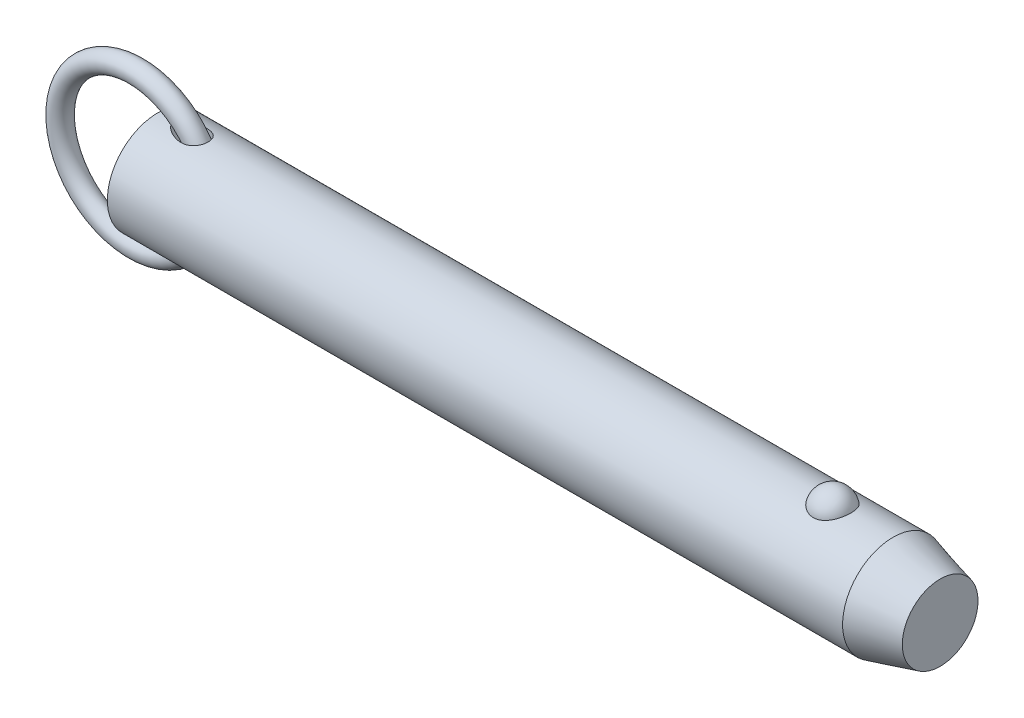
ISO-10303-21;
HEADER;
FILE_DESCRIPTION(('STEP AP214'),'2;1');
FILE_NAME('part.step','',(''),(''),'','','');
FILE_SCHEMA(('AUTOMOTIVE_DESIGN { 1 0 10303 214 1 1 1 1 }'));
ENDSEC;
DATA;
#1=APPLICATION_CONTEXT('core data for automotive mechanical design processes');
#2=APPLICATION_PROTOCOL_DEFINITION('international standard','automotive_design',2000,#1);
#3=PRODUCT_CONTEXT('',#1,'mechanical');
#4=PRODUCT('Part','Part','',(#3));
#5=PRODUCT_RELATED_PRODUCT_CATEGORY('part','',(#4));
#6=PRODUCT_DEFINITION_FORMATION('','',#4);
#7=PRODUCT_DEFINITION_CONTEXT('part definition',#1,'design');
#8=PRODUCT_DEFINITION('design','',#6,#7);
#9=PRODUCT_DEFINITION_SHAPE('','',#8);
#10=(LENGTH_UNIT() NAMED_UNIT(*) SI_UNIT(.MILLI.,.METRE.));
#11=(NAMED_UNIT(*) PLANE_ANGLE_UNIT() SI_UNIT($,.RADIAN.));
#12=(NAMED_UNIT(*) SI_UNIT($,.STERADIAN.) SOLID_ANGLE_UNIT());
#13=UNCERTAINTY_MEASURE_WITH_UNIT(LENGTH_MEASURE(1.E-05),#10,'distance_accuracy_value','');
#14=(GEOMETRIC_REPRESENTATION_CONTEXT(3) GLOBAL_UNCERTAINTY_ASSIGNED_CONTEXT((#13)) GLOBAL_UNIT_ASSIGNED_CONTEXT((#10,
#11,#12)) REPRESENTATION_CONTEXT('',''));
#15=CARTESIAN_POINT('',(0.,0.,0.));
#16=DIRECTION('',(0.,0.,1.));
#17=DIRECTION('',(1.,0.,0.));
#18=AXIS2_PLACEMENT_3D('',#15,#16,#17);
#19=CARTESIAN_POINT('',(-5.53898640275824,0.,0.));
#20=DIRECTION('',(0.,0.,1.));
#21=DIRECTION('',(1.,0.,0.));
#22=AXIS2_PLACEMENT_3D('',#19,#20,#21);
#23=TOROIDAL_SURFACE('',#22,19.05,2.54);
#24=CARTESIAN_POINT('',(16.0510135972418,0.,0.));
#25=VERTEX_POINT('',#24);
#26=VERTEX_LOOP('',#25);
#27=FACE_BOUND('',#26,.T.);
#28=ADVANCED_FACE('P0_F12',(#27),#23,.T.);
#29=CLOSED_SHELL('',(#28));
#30=MANIFOLD_SOLID_BREP('P0_B1',#29);
#31=CARTESIAN_POINT('',(0.,0.,0.));
#32=DIRECTION('',(1.,0.,0.));
#33=DIRECTION('',(0.,0.,-1.));
#34=AXIS2_PLACEMENT_3D('',#31,#32,#33);
#35=CYLINDRICAL_SURFACE('',#34,12.7);
#36=CARTESIAN_POINT('',(185.000738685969,0.,0.));
#37=DIRECTION('',(1.,0.,0.));
#38=DIRECTION('',(0.,0.,-1.));
#39=AXIS2_PLACEMENT_3D('',#36,#37,#38);
#40=CIRCLE('',#39,12.7);
#41=CARTESIAN_POINT('',(185.000738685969,0.,-12.7));
#42=VERTEX_POINT('',#41);
#43=EDGE_CURVE('P1_E89',#42,#42,#40,.T.);
#44=ORIENTED_EDGE('',*,*,#43,.F.);
#45=EDGE_LOOP('',(#44));
#46=FACE_BOUND('',#45,.T.);
#47=CARTESIAN_POINT('',(0.,0.,0.));
#48=DIRECTION('',(1.,0.,0.));
#49=DIRECTION('',(0.,0.,-1.));
#50=AXIS2_PLACEMENT_3D('',#47,#48,#49);
#51=CIRCLE('',#50,12.7);
#52=CARTESIAN_POINT('',(0.,0.,-12.7));
#53=VERTEX_POINT('',#52);
#54=EDGE_CURVE('P1_E52',#53,#53,#51,.T.);
#55=ORIENTED_EDGE('',*,*,#54,.T.);
#56=EDGE_LOOP('',(#55));
#57=FACE_BOUND('',#56,.T.);
#58=CARTESIAN_POINT('',(169.760042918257,11.7500437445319,4.81938502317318));
#59=CARTESIAN_POINT('',(169.635088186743,11.7500430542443,4.81938571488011));
#60=CARTESIAN_POINT('',(169.510144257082,11.7520975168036,4.81438658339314));
#61=CARTESIAN_POINT('',(169.261142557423,11.760253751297,4.79442904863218));
#62=CARTESIAN_POINT('',(169.137085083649,11.7663568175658,4.77946746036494));
#63=CARTESIAN_POINT('',(168.890901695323,11.7824262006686,4.7397141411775));
#64=CARTESIAN_POINT('',(168.768774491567,11.7923898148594,4.71492928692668));
#65=CARTESIAN_POINT('',(168.527187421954,11.8158938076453,4.65571340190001));
#66=CARTESIAN_POINT('',(168.40772859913,11.8294355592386,4.6212786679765));
#67=CARTESIAN_POINT('',(168.172557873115,11.8596812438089,4.54309502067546));
#68=CARTESIAN_POINT('',(168.056839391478,11.8763792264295,4.49936361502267));
#69=CARTESIAN_POINT('',(167.829653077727,11.9124878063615,4.40287235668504));
#70=CARTESIAN_POINT('',(167.718186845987,11.9318994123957,4.35010914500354));
#71=CARTESIAN_POINT('',(167.391278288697,11.9934256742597,4.17881316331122));
#72=CARTESIAN_POINT('',(167.183127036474,12.038858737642,4.04720756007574));
#73=CARTESIAN_POINT('',(166.785850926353,12.1352173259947,3.748564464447));
#74=CARTESIAN_POINT('',(166.597443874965,12.1862630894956,3.58061821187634));
#75=CARTESIAN_POINT('',(166.250521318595,12.2875163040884,3.21600758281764));
#76=CARTESIAN_POINT('',(166.092011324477,12.3377235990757,3.0193379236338));
#77=CARTESIAN_POINT('',(165.80168878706,12.4344923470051,2.592916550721));
#78=CARTESIAN_POINT('',(165.671376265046,12.4807925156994,2.36208286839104));
#79=CARTESIAN_POINT('',(165.449407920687,12.5623454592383,1.88070399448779));
#80=CARTESIAN_POINT('',(165.357755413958,12.5975972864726,1.63015711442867));
#81=CARTESIAN_POINT('',(165.214046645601,12.6538414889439,1.11298869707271));
#82=CARTESIAN_POINT('',(165.162499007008,12.6746503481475,0.846205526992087));
#83=CARTESIAN_POINT('',(165.101977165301,12.699153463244,0.307085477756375));
#84=CARTESIAN_POINT('',(165.093001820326,12.7028481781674,0.0347487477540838));
#85=CARTESIAN_POINT('',(165.117731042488,12.6927785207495,-0.506073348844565));
#86=CARTESIAN_POINT('',(165.151189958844,12.6791146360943,-0.774571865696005));
#87=CARTESIAN_POINT('',(165.259687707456,12.635882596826,-1.30170246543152));
#88=CARTESIAN_POINT('',(165.33472729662,12.606314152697,-1.56033436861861));
#89=CARTESIAN_POINT('',(165.52500006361,12.5342328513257,-2.0608389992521));
#90=CARTESIAN_POINT('',(165.640287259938,12.4917026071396,-2.30268867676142));
#91=CARTESIAN_POINT('',(165.908704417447,12.3981123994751,-2.76259600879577));
#92=CARTESIAN_POINT('',(166.061837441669,12.3470517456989,-2.98065173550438));
#93=CARTESIAN_POINT('',(166.403507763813,12.2416045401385,-3.38786328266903));
#94=CARTESIAN_POINT('',(166.592201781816,12.1872040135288,-3.57688418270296));
#95=CARTESIAN_POINT('',(167.000239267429,12.0814086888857,-3.91941073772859));
#96=CARTESIAN_POINT('',(167.219580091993,12.0300136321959,-4.07291945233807));
#97=CARTESIAN_POINT('',(167.678375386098,11.9373542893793,-4.33691289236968));
#98=CARTESIAN_POINT('',(167.917304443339,11.8958982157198,-4.44824125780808));
#99=CARTESIAN_POINT('',(168.41243761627,11.8268116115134,-4.62881985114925));
#100=CARTESIAN_POINT('',(168.668635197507,11.7991758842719,-4.69808589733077));
#101=CARTESIAN_POINT('',(169.177164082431,11.7622209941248,-4.78983181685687));
#102=CARTESIAN_POINT('',(169.429041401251,11.7520502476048,-4.81449025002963));
#103=CARTESIAN_POINT('',(169.933573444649,11.7485796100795,-4.82295735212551));
#104=CARTESIAN_POINT('',(170.186228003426,11.7552763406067,-4.80677420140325));
#105=CARTESIAN_POINT('',(170.676834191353,11.7842584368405,-4.73525430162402));
#106=CARTESIAN_POINT('',(170.914998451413,11.8060486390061,-4.68116061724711));
#107=CARTESIAN_POINT('',(171.378489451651,11.8622750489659,-4.53678133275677));
#108=CARTESIAN_POINT('',(171.603815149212,11.8967122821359,-4.44649279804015));
#109=CARTESIAN_POINT('',(172.040801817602,11.9754603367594,-4.2298761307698));
#110=CARTESIAN_POINT('',(172.252057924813,12.0199699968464,-4.10280539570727));
#111=CARTESIAN_POINT('',(172.650601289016,12.1138028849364,-3.81685409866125));
#112=CARTESIAN_POINT('',(172.837883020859,12.163127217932,-3.65796622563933));
#113=CARTESIAN_POINT('',(173.193350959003,12.2642343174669,-3.30364864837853));
#114=CARTESIAN_POINT('',(173.360111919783,12.3160165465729,-3.10678783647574));
#115=CARTESIAN_POINT('',(173.659579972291,12.4142566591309,-2.68748409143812));
#116=CARTESIAN_POINT('',(173.792280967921,12.4607135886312,-2.4650365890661));
#117=CARTESIAN_POINT('',(174.024691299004,12.5450236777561,-1.9928951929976));
#118=CARTESIAN_POINT('',(174.123215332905,12.5825557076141,-1.74255918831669));
#119=CARTESIAN_POINT('',(174.279227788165,12.6431720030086,-1.22773734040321));
#120=CARTESIAN_POINT('',(174.336715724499,12.6662560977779,-0.963251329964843));
#121=CARTESIAN_POINT('',(174.409544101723,12.6956486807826,-0.427355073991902));
#122=CARTESIAN_POINT('',(174.424837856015,12.7019385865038,-0.155937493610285));
#123=CARTESIAN_POINT('',(174.412779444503,12.6970201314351,0.38592890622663));
#124=CARTESIAN_POINT('',(174.38542805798,12.6858120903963,0.65637774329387));
#125=CARTESIAN_POINT('',(174.313060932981,12.6568455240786,1.05454017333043));
#126=CARTESIAN_POINT('',(174.283796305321,12.6451962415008,1.185778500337));
#127=CARTESIAN_POINT('',(174.215022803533,12.6181819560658,1.44513808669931));
#128=CARTESIAN_POINT('',(174.175517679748,12.6028183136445,1.57326046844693));
#129=CARTESIAN_POINT('',(174.086439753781,12.5687547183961,1.82554978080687));
#130=CARTESIAN_POINT('',(174.036862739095,12.5500533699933,1.94971503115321));
#131=CARTESIAN_POINT('',(173.92792115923,12.5098093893,2.19314370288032));
#132=CARTESIAN_POINT('',(173.868560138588,12.4882677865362,2.31240887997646));
#133=CARTESIAN_POINT('',(173.73997128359,12.4427679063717,2.5459303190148));
#134=CARTESIAN_POINT('',(173.670688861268,12.4187964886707,2.66015396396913));
#135=CARTESIAN_POINT('',(173.522903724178,12.3691892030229,2.88202659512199));
#136=CARTESIAN_POINT('',(173.444404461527,12.3435539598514,2.98967802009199));
#137=CARTESIAN_POINT('',(173.278550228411,12.2912955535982,3.1977438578));
#138=CARTESIAN_POINT('',(173.191191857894,12.2646720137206,3.298155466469));
#139=CARTESIAN_POINT('',(173.008161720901,12.2111945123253,3.49095035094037));
#140=CARTESIAN_POINT('',(172.912493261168,12.1843406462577,3.58333679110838));
#141=CARTESIAN_POINT('',(172.713627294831,12.1312249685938,3.7592287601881));
#142=CARTESIAN_POINT('',(172.610450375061,12.104961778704,3.84275713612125));
#143=CARTESIAN_POINT('',(172.39701336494,12.0537284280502,4.00056406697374));
#144=CARTESIAN_POINT('',(172.286756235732,12.028757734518,4.07484645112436));
#145=CARTESIAN_POINT('',(172.059755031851,11.9808306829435,4.21367959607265));
#146=CARTESIAN_POINT('',(171.943006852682,11.9578756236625,4.27822410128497));
#147=CARTESIAN_POINT('',(171.70394258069,11.9147184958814,4.39698483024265));
#148=CARTESIAN_POINT('',(171.581628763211,11.894515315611,4.45120522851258));
#149=CARTESIAN_POINT('',(171.322952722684,11.8561129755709,4.55255353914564));
#150=CARTESIAN_POINT('',(171.186223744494,11.8381764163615,4.59884858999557));
#151=CARTESIAN_POINT('',(170.908608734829,11.8069093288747,4.67853897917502));
#152=CARTESIAN_POINT('',(170.767724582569,11.7935767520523,4.71194005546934));
#153=CARTESIAN_POINT('',(170.48309446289,11.7720277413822,4.76552188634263));
#154=CARTESIAN_POINT('',(170.339348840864,11.7638106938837,4.78570422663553));
#155=CARTESIAN_POINT('',(170.050411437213,11.7528195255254,4.81263433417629));
#156=CARTESIAN_POINT('',(169.905219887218,11.7500445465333,4.81938421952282));
#157=CARTESIAN_POINT('',(169.760042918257,11.7500437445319,4.81938502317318));
#158=B_SPLINE_CURVE_WITH_KNOTS('',3,(#58,#59,#60,#61,#62,#63,#64,#65,#66,#67,#68,#69,#70,#71,
#72,#73,#74,#75,#76,#77,#78,#79,#80,#81,#82,#83,#84,#85,#86,#87,#88,#89,#90,#91,#92,#93,#94,#95,
#96,#97,#98,#99,#100,#101,#102,#103,#104,#105,#106,#107,#108,#109,#110,#111,#112,#113,#114,#115,
#116,#117,#118,#119,#120,#121,#122,#123,#124,#125,#126,#127,#128,#129,#130,#131,#132,#133,#134,
#135,#136,#137,#138,#139,#140,#141,#142,#143,#144,#145,#146,#147,#148,#149,#150,#151,#152,#153,
#154,#155,#156,#157),.UNSPECIFIED.,.T.,.F.,(4,2,2,2,2,2,2,2,2,2,2,2,2,2,2,2,2,2,2,2,2,2,2,2,2,2,
2,2,2,2,2,2,2,2,2,2,2,2,2,2,2,2,2,2,2,2,2,2,2,4),(0.,0.374729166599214,0.749578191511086,
1.12416526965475,1.49889629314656,1.87292776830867,2.24709865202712,2.99481328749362,
3.76399449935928,4.53331735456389,5.3368391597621,6.14042986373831,6.95405296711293,
7.76765424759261,8.57656703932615,9.38549455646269,10.1955119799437,11.0055949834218,
11.8193353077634,12.6330054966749,13.4294141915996,14.2255231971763,14.9815786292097,
15.7374826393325,16.4696948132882,17.2019663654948,17.9501979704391,18.6986017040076,
19.4844704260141,20.2704797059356,21.0815215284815,21.8925729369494,22.7045213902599,
23.5164550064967,23.9209608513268,24.3253187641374,24.7298461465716,25.1342272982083,
25.54092555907,25.9474719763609,26.3541750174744,26.7607169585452,27.1661834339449,
27.5714814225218,27.9770386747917,28.3824315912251,28.8181206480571,29.2536155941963,
29.6890582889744,30.1244323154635),.UNSPECIFIED.);
#159=CARTESIAN_POINT('',(169.760042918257,11.7500437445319,4.81938502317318));
#160=VERTEX_POINT('',#159);
#161=EDGE_CURVE('P1_E80',#160,#160,#158,.T.);
#162=ORIENTED_EDGE('',*,*,#161,.T.);
#163=EDGE_LOOP('',(#162));
#164=FACE_BOUND('',#163,.T.);
#165=CARTESIAN_POINT('',(-5.53898640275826,0.,0.));
#166=DIRECTION('',(0.796400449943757,-0.604769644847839,0.));
#167=DIRECTION('',(0.604769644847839,0.796400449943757,0.));
#168=AXIS2_PLACEMENT_3D('',#165,#166,#167);
#169=ELLIPSE('',#168,15.9467514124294,12.7);
#170=CARTESIAN_POINT('',(4.09482149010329,12.6864319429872,0.586893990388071));
#171=VERTEX_POINT('',#170);
#172=CARTESIAN_POINT('',(4.09482149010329,12.6864319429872,-0.586893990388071));
#173=VERTEX_POINT('',#172);
#174=EDGE_CURVE('P1_E47',#171,#173,#169,.F.);
#175=ORIENTED_EDGE('',*,*,#174,.T.);
#176=CARTESIAN_POINT('',(4.06153170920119,12.6905758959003,-0.48916605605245));
#177=CARTESIAN_POINT('',(4.0811137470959,12.6881366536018,-0.552489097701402));
#178=CARTESIAN_POINT('',(4.1041785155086,12.6852663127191,-0.614604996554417));
#179=CARTESIAN_POINT('',(4.15628434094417,12.6787965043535,-0.736067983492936));
#180=CARTESIAN_POINT('',(4.18531032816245,12.6751988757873,-0.795421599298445));
#181=CARTESIAN_POINT('',(4.27911159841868,12.6636052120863,-0.967590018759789));
#182=CARTESIAN_POINT('',(4.35123408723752,12.654730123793,-1.07635920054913));
#183=CARTESIAN_POINT('',(4.49106800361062,12.6376715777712,-1.25922957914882));
#184=CARTESIAN_POINT('',(4.55601066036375,12.6297947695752,-1.33556751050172));
#185=CARTESIAN_POINT('',(4.692236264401,12.6134116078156,-1.4823274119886));
#186=CARTESIAN_POINT('',(4.76352147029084,12.6049050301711,-1.55274725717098));
#187=CARTESIAN_POINT('',(4.91163946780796,12.587417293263,-1.68868704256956));
#188=CARTESIAN_POINT('',(4.98851399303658,12.5784327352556,-1.75416062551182));
#189=CARTESIAN_POINT('',(5.14630057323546,12.560235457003,-1.88003275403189));
#190=CARTESIAN_POINT('',(5.22721398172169,12.5510226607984,-1.94042957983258));
#191=CARTESIAN_POINT('',(5.45368877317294,12.5256514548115,-2.09966332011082));
#192=CARTESIAN_POINT('',(5.60261616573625,12.5094182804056,-2.19371988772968));
#193=CARTESIAN_POINT('',(5.90795545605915,12.4774211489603,-2.36893890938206));
#194=CARTESIAN_POINT('',(6.0643723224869,12.4616575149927,-2.45009264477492));
#195=CARTESIAN_POINT('',(6.38306132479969,12.431227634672,-2.6000824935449));
#196=CARTESIAN_POINT('',(6.54533237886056,12.4165611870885,-2.66892086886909));
#197=CARTESIAN_POINT('',(6.87462618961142,12.3889351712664,-2.79435199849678));
#198=CARTESIAN_POINT('',(7.04164773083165,12.3759751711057,-2.85094785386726));
#199=CARTESIAN_POINT('',(7.38726647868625,12.3518460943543,-2.95377962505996));
#200=CARTESIAN_POINT('',(7.56604577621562,12.3407843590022,-2.99943209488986));
#201=CARTESIAN_POINT('',(7.92698692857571,12.3219309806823,-3.07596683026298));
#202=CARTESIAN_POINT('',(8.10914972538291,12.314140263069,-3.10684491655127));
#203=CARTESIAN_POINT('',(8.47511457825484,12.3025918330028,-3.15226850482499));
#204=CARTESIAN_POINT('',(8.6589097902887,12.2988216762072,-3.16686440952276));
#205=CARTESIAN_POINT('',(9.02696087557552,12.2959421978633,-3.17802250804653));
#206=CARTESIAN_POINT('',(9.21121628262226,12.2968292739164,-3.17459864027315));
#207=CARTESIAN_POINT('',(9.61636263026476,12.3045198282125,-3.14471110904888));
#208=CARTESIAN_POINT('',(9.83695552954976,12.3125080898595,-3.11363232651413));
#209=CARTESIAN_POINT('',(10.1619126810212,12.3303028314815,-3.04206574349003));
#210=CARTESIAN_POINT('',(10.2692747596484,12.3372061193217,-3.01403983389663));
#211=CARTESIAN_POINT('',(10.4811758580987,12.3528538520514,-2.94925947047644));
#212=CARTESIAN_POINT('',(10.5857162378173,12.361597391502,-2.91250930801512));
#213=CARTESIAN_POINT('',(10.792132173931,12.3808585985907,-2.8295174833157));
#214=CARTESIAN_POINT('',(10.8939665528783,12.3913944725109,-2.78317723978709));
#215=CARTESIAN_POINT('',(11.092611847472,12.4138762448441,-2.68112002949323));
#216=CARTESIAN_POINT('',(11.1894254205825,12.4258213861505,-2.62540809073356));
#217=CARTESIAN_POINT('',(11.3768740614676,12.4507225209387,-2.50465655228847));
#218=CARTESIAN_POINT('',(11.4675115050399,12.4636781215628,-2.43962056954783));
#219=CARTESIAN_POINT('',(11.6414572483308,12.4901070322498,-2.30048560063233));
#220=CARTESIAN_POINT('',(11.7247669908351,12.5035802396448,-2.22638840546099));
#221=CARTESIAN_POINT('',(11.8713131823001,12.5285000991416,-2.08117367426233));
#222=CARTESIAN_POINT('',(11.9357009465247,12.5399538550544,-2.01121596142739));
#223=CARTESIAN_POINT('',(12.0576805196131,12.5624496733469,-1.86555293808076));
#224=CARTESIAN_POINT('',(12.1152732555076,12.5734917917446,-1.7898484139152));
#225=CARTESIAN_POINT('',(12.223073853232,12.5947858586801,-1.63327883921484));
#226=CARTESIAN_POINT('',(12.2732844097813,12.6050380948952,-1.5524156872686));
#227=CARTESIAN_POINT('',(12.3658430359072,12.6243983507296,-1.38621267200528));
#228=CARTESIAN_POINT('',(12.408191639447,12.6335064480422,-1.30087311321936));
#229=CARTESIAN_POINT('',(12.5150098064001,12.6569076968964,-1.05702619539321));
#230=CARTESIAN_POINT('',(12.5703399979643,12.6695746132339,-0.894232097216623));
#231=CARTESIAN_POINT('',(12.6526225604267,12.6886816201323,-0.561391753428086));
#232=CARTESIAN_POINT('',(12.6795825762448,12.6951233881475,-0.391347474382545));
#233=CARTESIAN_POINT('',(12.7041016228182,12.7009766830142,-0.0537636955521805));
#234=CARTESIAN_POINT('',(12.7024538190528,12.7005778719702,0.113714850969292));
#235=CARTESIAN_POINT('',(12.6717240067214,12.6932548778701,0.445979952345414));
#236=CARTESIAN_POINT('',(12.6426435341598,12.6863310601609,0.610766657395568));
#237=CARTESIAN_POINT('',(12.5579769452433,12.6667465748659,0.932429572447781));
#238=CARTESIAN_POINT('',(12.5024793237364,12.6541050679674,1.08933027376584));
#239=CARTESIAN_POINT('',(12.3665691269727,12.6244558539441,1.39146752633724));
#240=CARTESIAN_POINT('',(12.2861577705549,12.6074483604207,1.53670464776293));
#241=CARTESIAN_POINT('',(12.1018203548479,12.5706804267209,1.81319588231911));
#242=CARTESIAN_POINT('',(11.9976588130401,12.5508932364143,1.94428915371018));
#243=CARTESIAN_POINT('',(11.7695265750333,12.5107540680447,2.18776051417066));
#244=CARTESIAN_POINT('',(11.6455540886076,12.4904020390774,2.3001369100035));
#245=CARTESIAN_POINT('',(11.3759347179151,12.4502278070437,2.50870972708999));
#246=CARTESIAN_POINT('',(11.2295880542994,12.4304654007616,2.60400962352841));
#247=CARTESIAN_POINT('',(10.9239803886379,12.3941696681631,2.77162929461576));
#248=CARTESIAN_POINT('',(10.7647152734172,12.3776373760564,2.84394171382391));
#249=CARTESIAN_POINT('',(10.4192039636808,12.3473062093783,2.97303525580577));
#250=CARTESIAN_POINT('',(10.2319332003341,12.3340204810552,3.027171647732));
#251=CARTESIAN_POINT('',(9.85152982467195,12.3134301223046,3.10986173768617));
#252=CARTESIAN_POINT('',(9.65839336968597,12.3061295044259,3.13839827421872));
#253=CARTESIAN_POINT('',(9.31022514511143,12.2982822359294,3.16897517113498));
#254=CARTESIAN_POINT('',(9.15555718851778,12.2966525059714,3.17526894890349));
#255=CARTESIAN_POINT('',(8.84618945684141,12.2967963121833,3.17471335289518));
#256=CARTESIAN_POINT('',(8.6914897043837,12.2985715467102,3.16785742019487));
#257=CARTESIAN_POINT('',(8.38280471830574,12.3051648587,3.14214692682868));
#258=CARTESIAN_POINT('',(8.22882218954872,12.3099904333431,3.12326280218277));
#259=CARTESIAN_POINT('',(7.92276070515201,12.3222644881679,3.07448013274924));
#260=CARTESIAN_POINT('',(7.77068148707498,12.3297126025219,3.04458312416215));
#261=CARTESIAN_POINT('',(7.46452663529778,12.3470493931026,2.97350781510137));
#262=CARTESIAN_POINT('',(7.31052714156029,12.3570043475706,2.93201910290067));
#263=CARTESIAN_POINT('',(7.00579083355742,12.3787609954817,2.83876185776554));
#264=CARTESIAN_POINT('',(6.85505451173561,12.3905629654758,2.7869917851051));
#265=CARTESIAN_POINT('',(6.55781208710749,12.415528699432,2.67357744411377));
#266=CARTESIAN_POINT('',(6.41129783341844,12.4286895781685,2.61195394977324));
#267=CARTESIAN_POINT('',(6.12302950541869,12.4559398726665,2.47874512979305));
#268=CARTESIAN_POINT('',(5.98127390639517,12.4700289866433,2.40716303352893));
#269=CARTESIAN_POINT('',(5.67073126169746,12.5020754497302,2.23550426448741));
#270=CARTESIAN_POINT('',(5.50343839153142,12.5201625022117,2.13268685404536));
#271=CARTESIAN_POINT('',(5.26147616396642,12.5471537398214,1.96522579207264));
#272=CARTESIAN_POINT('',(5.18224299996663,12.5561365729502,1.90713440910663));
#273=CARTESIAN_POINT('',(5.0274647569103,12.5739122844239,1.78618989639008));
#274=CARTESIAN_POINT('',(4.95191912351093,12.5827051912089,1.72333748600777));
#275=CARTESIAN_POINT('',(4.81787163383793,12.598469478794,1.60360864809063));
#276=CARTESIAN_POINT('',(4.75865966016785,12.6054958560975,1.54753994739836));
#277=CARTESIAN_POINT('',(4.64406285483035,12.6191906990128,1.43158546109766));
#278=CARTESIAN_POINT('',(4.58867926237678,12.6258590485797,1.37169845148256));
#279=CARTESIAN_POINT('',(4.43014912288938,12.6450546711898,1.18656670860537));
#280=CARTESIAN_POINT('',(4.33372726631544,12.6568788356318,1.05507993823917));
#281=CARTESIAN_POINT('',(4.21252055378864,12.6718304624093,0.848052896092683));
#282=CARTESIAN_POINT('',(4.17660155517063,12.6762773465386,0.779100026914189));
#283=CARTESIAN_POINT('',(4.11264979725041,12.6842122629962,0.637080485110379));
#284=CARTESIAN_POINT('',(4.08466792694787,12.6876941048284,0.563990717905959));
#285=CARTESIAN_POINT('',(4.06153170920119,12.6905758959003,0.489166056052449));
#286=B_SPLINE_CURVE_WITH_KNOTS('',3,(#176,#177,#178,#179,#180,#181,#182,#183,#184,#185,#186,
#187,#188,#189,#190,#191,#192,#193,#194,#195,#196,#197,#198,#199,#200,#201,#202,#203,#204,#205,
#206,#207,#208,#209,#210,#211,#212,#213,#214,#215,#216,#217,#218,#219,#220,#221,#222,#223,#224,
#225,#226,#227,#228,#229,#230,#231,#232,#233,#234,#235,#236,#237,#238,#239,#240,#241,#242,#243,
#244,#245,#246,#247,#248,#249,#250,#251,#252,#253,#254,#255,#256,#257,#258,#259,#260,#261,#262,
#263,#264,#265,#266,#267,#268,#269,#270,#271,#272,#273,#274,#275,#276,#277,#278,#279,#280,#281,
#282,#283,#284,#285),.UNSPECIFIED.,.F.,.F.,(4,2,2,2,2,2,2,2,2,2,2,2,2,2,2,2,2,2,2,2,2,2,2,2,2,2,
2,2,2,2,2,2,2,2,2,2,2,2,2,2,2,2,2,2,2,2,2,2,2,2,2,2,2,2,4),(0.,0.198708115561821,
0.39691995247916,0.787580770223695,1.08882492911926,1.3901767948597,1.69407136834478,
1.9980684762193,2.52793143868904,3.05815092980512,3.58827293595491,4.1182605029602,
4.67218806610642,5.22627222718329,5.77863637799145,6.33057333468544,6.99657211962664,
7.32977411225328,7.66281254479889,7.99946156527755,8.33593054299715,8.6722693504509,
9.00854178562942,9.29544181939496,9.58230266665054,9.8690585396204,10.155794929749,
10.670233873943,11.184534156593,11.6845985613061,12.1846349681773,12.6830079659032,
13.1813565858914,13.6848795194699,14.1884479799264,14.7135333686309,15.2387866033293,
15.8228373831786,16.4072794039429,16.8710810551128,17.3351141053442,17.8002921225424,
18.2654052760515,18.7444169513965,19.2235004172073,19.7015868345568,20.1795185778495,
20.7699825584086,21.0658110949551,21.361595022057,21.6069574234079,21.8523988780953,
22.3397467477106,22.5729183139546,22.8075527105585),.UNSPECIFIED.);
#287=EDGE_CURVE('P1_E51',#173,#171,#286,.T.);
#288=ORIENTED_EDGE('',*,*,#287,.T.);
#289=EDGE_LOOP('',(#175,#288));
#290=FACE_BOUND('',#289,.T.);
#291=CARTESIAN_POINT('',(-5.53898640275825,0.,0.));
#292=DIRECTION('',(-0.796400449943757,-0.604769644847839,0.));
#293=DIRECTION('',(0.604769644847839,-0.796400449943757,0.));
#294=AXIS2_PLACEMENT_3D('',#291,#292,#293);
#295=ELLIPSE('',#294,15.9467514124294,12.7);
#296=CARTESIAN_POINT('',(4.0948214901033,-12.6864319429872,0.586893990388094));
#297=VERTEX_POINT('',#296);
#298=CARTESIAN_POINT('',(4.0948214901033,-12.6864319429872,-0.586893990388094));
#299=VERTEX_POINT('',#298);
#300=EDGE_CURVE('P1_E28',#297,#299,#295,.F.);
#301=ORIENTED_EDGE('',*,*,#300,.F.);
#302=CARTESIAN_POINT('',(4.06153170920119,-12.6905758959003,0.489166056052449));
#303=CARTESIAN_POINT('',(4.08111374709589,-12.6881366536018,0.552489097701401));
#304=CARTESIAN_POINT('',(4.1041785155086,-12.6852663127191,0.614604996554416));
#305=CARTESIAN_POINT('',(4.15628434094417,-12.6787965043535,0.736067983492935));
#306=CARTESIAN_POINT('',(4.18531032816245,-12.6751988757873,0.795421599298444));
#307=CARTESIAN_POINT('',(4.27911159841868,-12.6636052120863,0.967590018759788));
#308=CARTESIAN_POINT('',(4.35123408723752,-12.654730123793,1.07635920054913));
#309=CARTESIAN_POINT('',(4.49106800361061,-12.6376715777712,1.25922957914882));
#310=CARTESIAN_POINT('',(4.55601066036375,-12.6297947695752,1.33556751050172));
#311=CARTESIAN_POINT('',(4.692236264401,-12.6134116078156,1.48232741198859));
#312=CARTESIAN_POINT('',(4.76352147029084,-12.6049050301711,1.55274725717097));
#313=CARTESIAN_POINT('',(4.91163946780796,-12.587417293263,1.68868704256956));
#314=CARTESIAN_POINT('',(4.98851399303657,-12.5784327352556,1.75416062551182));
#315=CARTESIAN_POINT('',(5.14630057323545,-12.560235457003,1.88003275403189));
#316=CARTESIAN_POINT('',(5.22721398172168,-12.5510226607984,1.94042957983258));
#317=CARTESIAN_POINT('',(5.45368877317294,-12.5256514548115,2.09966332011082));
#318=CARTESIAN_POINT('',(5.60261616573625,-12.5094182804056,2.19371988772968));
#319=CARTESIAN_POINT('',(5.90795545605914,-12.4774211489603,2.36893890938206));
#320=CARTESIAN_POINT('',(6.06437232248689,-12.4616575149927,2.45009264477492));
#321=CARTESIAN_POINT('',(6.38306132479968,-12.431227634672,2.6000824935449));
#322=CARTESIAN_POINT('',(6.54533237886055,-12.4165611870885,2.66892086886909));
#323=CARTESIAN_POINT('',(6.87462618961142,-12.3889351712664,2.79435199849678));
#324=CARTESIAN_POINT('',(7.04164773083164,-12.3759751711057,2.85094785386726));
#325=CARTESIAN_POINT('',(7.38726647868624,-12.3518460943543,2.95377962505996));
#326=CARTESIAN_POINT('',(7.56604577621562,-12.3407843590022,2.99943209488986));
#327=CARTESIAN_POINT('',(7.92698692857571,-12.3219309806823,3.07596683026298));
#328=CARTESIAN_POINT('',(8.1091497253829,-12.314140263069,3.10684491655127));
#329=CARTESIAN_POINT('',(8.47511457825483,-12.3025918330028,3.15226850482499));
#330=CARTESIAN_POINT('',(8.65890979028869,-12.2988216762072,3.16686440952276));
#331=CARTESIAN_POINT('',(9.02696087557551,-12.2959421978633,3.17802250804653));
#332=CARTESIAN_POINT('',(9.21121628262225,-12.2968292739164,3.17459864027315));
#333=CARTESIAN_POINT('',(9.61636263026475,-12.3045198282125,3.14471110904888));
#334=CARTESIAN_POINT('',(9.83695552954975,-12.3125080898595,3.11363232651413));
#335=CARTESIAN_POINT('',(10.1619126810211,-12.3303028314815,3.04206574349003));
#336=CARTESIAN_POINT('',(10.2692747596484,-12.3372061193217,3.01403983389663));
#337=CARTESIAN_POINT('',(10.4811758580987,-12.3528538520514,2.94925947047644));
#338=CARTESIAN_POINT('',(10.5857162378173,-12.361597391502,2.91250930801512));
#339=CARTESIAN_POINT('',(10.792132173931,-12.3808585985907,2.8295174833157));
#340=CARTESIAN_POINT('',(10.8939665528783,-12.3913944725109,2.78317723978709));
#341=CARTESIAN_POINT('',(11.092611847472,-12.4138762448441,2.68112002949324));
#342=CARTESIAN_POINT('',(11.1894254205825,-12.4258213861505,2.62540809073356));
#343=CARTESIAN_POINT('',(11.3768740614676,-12.4507225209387,2.50465655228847));
#344=CARTESIAN_POINT('',(11.4675115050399,-12.4636781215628,2.43962056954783));
#345=CARTESIAN_POINT('',(11.6414572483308,-12.4901070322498,2.30048560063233));
#346=CARTESIAN_POINT('',(11.7247669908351,-12.5035802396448,2.22638840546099));
#347=CARTESIAN_POINT('',(11.8713131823,-12.5285000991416,2.08117367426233));
#348=CARTESIAN_POINT('',(11.9357009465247,-12.5399538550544,2.01121596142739));
#349=CARTESIAN_POINT('',(12.0576805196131,-12.5624496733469,1.86555293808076));
#350=CARTESIAN_POINT('',(12.1152732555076,-12.5734917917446,1.7898484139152));
#351=CARTESIAN_POINT('',(12.223073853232,-12.5947858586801,1.63327883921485));
#352=CARTESIAN_POINT('',(12.2732844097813,-12.6050380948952,1.5524156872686));
#353=CARTESIAN_POINT('',(12.3658430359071,-12.6243983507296,1.38621267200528));
#354=CARTESIAN_POINT('',(12.408191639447,-12.6335064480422,1.30087311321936));
#355=CARTESIAN_POINT('',(12.5150098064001,-12.6569076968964,1.05702619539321));
#356=CARTESIAN_POINT('',(12.5703399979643,-12.6695746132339,0.894232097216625));
#357=CARTESIAN_POINT('',(12.6526225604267,-12.6886816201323,0.56139175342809));
#358=CARTESIAN_POINT('',(12.6795825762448,-12.6951233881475,0.39134747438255));
#359=CARTESIAN_POINT('',(12.7041016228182,-12.7009766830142,0.0537636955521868));
#360=CARTESIAN_POINT('',(12.7024538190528,-12.7005778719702,-0.113714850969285));
#361=CARTESIAN_POINT('',(12.6717240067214,-12.6932548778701,-0.445979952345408));
#362=CARTESIAN_POINT('',(12.6426435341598,-12.6863310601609,-0.610766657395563));
#363=CARTESIAN_POINT('',(12.5579769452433,-12.6667465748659,-0.932429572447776));
#364=CARTESIAN_POINT('',(12.5024793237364,-12.6541050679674,-1.08933027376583));
#365=CARTESIAN_POINT('',(12.3665691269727,-12.6244558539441,-1.39146752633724));
#366=CARTESIAN_POINT('',(12.2861577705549,-12.6074483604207,-1.53670464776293));
#367=CARTESIAN_POINT('',(12.1018203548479,-12.5706804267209,-1.81319588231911));
#368=CARTESIAN_POINT('',(11.9976588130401,-12.5508932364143,-1.94428915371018));
#369=CARTESIAN_POINT('',(11.7695265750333,-12.5107540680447,-2.18776051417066));
#370=CARTESIAN_POINT('',(11.6455540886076,-12.4904020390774,-2.3001369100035));
#371=CARTESIAN_POINT('',(11.3759347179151,-12.4502278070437,-2.50870972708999));
#372=CARTESIAN_POINT('',(11.2295880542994,-12.4304654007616,-2.60400962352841));
#373=CARTESIAN_POINT('',(10.9239803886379,-12.3941696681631,-2.77162929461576));
#374=CARTESIAN_POINT('',(10.7647152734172,-12.3776373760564,-2.84394171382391));
#375=CARTESIAN_POINT('',(10.4192039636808,-12.3473062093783,-2.97303525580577));
#376=CARTESIAN_POINT('',(10.2319332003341,-12.3340204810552,-3.027171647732));
#377=CARTESIAN_POINT('',(9.85152982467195,-12.3134301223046,-3.10986173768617));
#378=CARTESIAN_POINT('',(9.65839336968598,-12.3061295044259,-3.13839827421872));
#379=CARTESIAN_POINT('',(9.31022514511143,-12.2982822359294,-3.16897517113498));
#380=CARTESIAN_POINT('',(9.15555718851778,-12.2966525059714,-3.17526894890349));
#381=CARTESIAN_POINT('',(8.84618945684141,-12.2967963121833,-3.17471335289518));
#382=CARTESIAN_POINT('',(8.6914897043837,-12.2985715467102,-3.16785742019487));
#383=CARTESIAN_POINT('',(8.38280471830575,-12.3051648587,-3.14214692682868));
#384=CARTESIAN_POINT('',(8.22882218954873,-12.3099904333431,-3.12326280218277));
#385=CARTESIAN_POINT('',(7.92276070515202,-12.3222644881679,-3.07448013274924));
#386=CARTESIAN_POINT('',(7.77068148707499,-12.3297126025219,-3.04458312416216));
#387=CARTESIAN_POINT('',(7.46452663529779,-12.3470493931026,-2.97350781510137));
#388=CARTESIAN_POINT('',(7.3105271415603,-12.3570043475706,-2.93201910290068));
#389=CARTESIAN_POINT('',(7.00579083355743,-12.3787609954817,-2.83876185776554));
#390=CARTESIAN_POINT('',(6.85505451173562,-12.3905629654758,-2.78699178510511));
#391=CARTESIAN_POINT('',(6.5578120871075,-12.415528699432,-2.67357744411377));
#392=CARTESIAN_POINT('',(6.41129783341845,-12.4286895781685,-2.61195394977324));
#393=CARTESIAN_POINT('',(6.12302950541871,-12.4559398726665,-2.47874512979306));
#394=CARTESIAN_POINT('',(5.98127390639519,-12.4700289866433,-2.40716303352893));
#395=CARTESIAN_POINT('',(5.67073126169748,-12.5020754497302,-2.23550426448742));
#396=CARTESIAN_POINT('',(5.50343839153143,-12.5201625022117,-2.13268685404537));
#397=CARTESIAN_POINT('',(5.26147616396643,-12.5471537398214,-1.96522579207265));
#398=CARTESIAN_POINT('',(5.18224299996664,-12.5561365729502,-1.90713440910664));
#399=CARTESIAN_POINT('',(5.02746475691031,-12.5739122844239,-1.78618989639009));
#400=CARTESIAN_POINT('',(4.95191912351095,-12.5827051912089,-1.72333748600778));
#401=CARTESIAN_POINT('',(4.81787163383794,-12.598469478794,-1.60360864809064));
#402=CARTESIAN_POINT('',(4.75865966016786,-12.6054958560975,-1.54753994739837));
#403=CARTESIAN_POINT('',(4.64406285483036,-12.6191906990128,-1.43158546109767));
#404=CARTESIAN_POINT('',(4.58867926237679,-12.6258590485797,-1.37169845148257));
#405=CARTESIAN_POINT('',(4.43014912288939,-12.6450546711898,-1.18656670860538));
#406=CARTESIAN_POINT('',(4.33372726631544,-12.6568788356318,-1.05507993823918));
#407=CARTESIAN_POINT('',(4.21252055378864,-12.6718304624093,-0.848052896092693));
#408=CARTESIAN_POINT('',(4.17660155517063,-12.6762773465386,-0.779100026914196));
#409=CARTESIAN_POINT('',(4.11264979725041,-12.6842122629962,-0.637080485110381));
#410=CARTESIAN_POINT('',(4.08466792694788,-12.6876941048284,-0.563990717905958));
#411=CARTESIAN_POINT('',(4.0615317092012,-12.6905758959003,-0.489166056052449));
#412=B_SPLINE_CURVE_WITH_KNOTS('',3,(#302,#303,#304,#305,#306,#307,#308,#309,#310,#311,#312,
#313,#314,#315,#316,#317,#318,#319,#320,#321,#322,#323,#324,#325,#326,#327,#328,#329,#330,#331,
#332,#333,#334,#335,#336,#337,#338,#339,#340,#341,#342,#343,#344,#345,#346,#347,#348,#349,#350,
#351,#352,#353,#354,#355,#356,#357,#358,#359,#360,#361,#362,#363,#364,#365,#366,#367,#368,#369,
#370,#371,#372,#373,#374,#375,#376,#377,#378,#379,#380,#381,#382,#383,#384,#385,#386,#387,#388,
#389,#390,#391,#392,#393,#394,#395,#396,#397,#398,#399,#400,#401,#402,#403,#404,#405,#406,#407,
#408,#409,#410,#411),.UNSPECIFIED.,.F.,.F.,(4,2,2,2,2,2,2,2,2,2,2,2,2,2,2,2,2,2,2,2,2,2,2,2,2,2,
2,2,2,2,2,2,2,2,2,2,2,2,2,2,2,2,2,2,2,2,2,2,2,2,2,2,2,2,4),(0.,0.198708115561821,
0.39691995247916,0.787580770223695,1.08882492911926,1.3901767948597,1.69407136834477,
1.9980684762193,2.52793143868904,3.05815092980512,3.5882729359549,4.1182605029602,
4.67218806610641,5.22627222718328,5.77863637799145,6.33057333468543,6.99657211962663,
7.32977411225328,7.66281254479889,7.99946156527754,8.33593054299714,8.6722693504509,
9.00854178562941,9.29544181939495,9.58230266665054,9.8690585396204,10.155794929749,
10.670233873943,11.184534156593,11.6845985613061,12.1846349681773,12.6830079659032,
13.1813565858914,13.6848795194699,14.1884479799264,14.7135333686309,15.2387866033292,
15.8228373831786,16.4072794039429,16.8710810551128,17.3351141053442,17.8002921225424,
18.2654052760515,18.7444169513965,19.2235004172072,19.7015868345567,20.1795185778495,
20.7699825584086,21.0658110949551,21.361595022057,21.6069574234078,21.8523988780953,
22.3397467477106,22.5729183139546,22.8075527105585),.UNSPECIFIED.);
#413=EDGE_CURVE('P1_E10',#297,#299,#412,.T.);
#414=ORIENTED_EDGE('',*,*,#413,.T.);
#415=EDGE_LOOP('',(#301,#414));
#416=FACE_BOUND('',#415,.T.);
#417=ADVANCED_FACE('P1_F15',(#46,#57,#164,#290,#416),#35,.T.);
#418=CARTESIAN_POINT('',(0.,0.,0.));
#419=DIRECTION('',(-1.,0.,0.));
#420=DIRECTION('',(0.,0.,1.));
#421=AXIS2_PLACEMENT_3D('',#418,#419,#420);
#422=PLANE('',#421);
#423=ORIENTED_EDGE('',*,*,#54,.F.);
#424=EDGE_LOOP('',(#423));
#425=FACE_BOUND('',#424,.T.);
#426=ADVANCED_FACE('P1_F17',(#425),#422,.T.);
#427=CARTESIAN_POINT('',(196.85,0.,0.));
#428=DIRECTION('',(-1.,0.,0.));
#429=DIRECTION('',(0.,0.,1.));
#430=AXIS2_PLACEMENT_3D('',#427,#428,#429);
#431=CONICAL_SURFACE('',#430,9.52500000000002,0.26179938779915);
#432=ORIENTED_EDGE('',*,*,#43,.T.);
#433=EDGE_LOOP('',(#432));
#434=FACE_BOUND('',#433,.T.);
#435=CARTESIAN_POINT('',(196.85,0.,0.));
#436=DIRECTION('',(1.,0.,0.));
#437=DIRECTION('',(0.,0.,-1.));
#438=AXIS2_PLACEMENT_3D('',#435,#436,#437);
#439=CIRCLE('',#438,9.52500000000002);
#440=CARTESIAN_POINT('',(196.85,0.,-9.52500000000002));
#441=VERTEX_POINT('',#440);
#442=EDGE_CURVE('P1_E86',#441,#441,#439,.T.);
#443=ORIENTED_EDGE('',*,*,#442,.F.);
#444=EDGE_LOOP('',(#443));
#445=FACE_BOUND('',#444,.T.);
#446=ADVANCED_FACE('P1_F105',(#434,#445),#431,.T.);
#447=CARTESIAN_POINT('',(196.85,9.52500000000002,0.));
#448=DIRECTION('',(1.,0.,0.));
#449=DIRECTION('',(0.,0.,-1.));
#450=AXIS2_PLACEMENT_3D('',#447,#448,#449);
#451=PLANE('',#450);
#452=ORIENTED_EDGE('',*,*,#442,.T.);
#453=EDGE_LOOP('',(#452));
#454=FACE_BOUND('',#453,.T.);
#455=ADVANCED_FACE('P1_F78',(#454),#451,.T.);
#456=CARTESIAN_POINT('',(169.760042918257,11.43,0.));
#457=DIRECTION('',(-1.,0.,0.));
#458=DIRECTION('',(0.,-1.,0.));
#459=AXIS2_PLACEMENT_3D('',#456,#457,#458);
#460=SPHERICAL_SURFACE('',#459,4.83);
#461=ORIENTED_EDGE('',*,*,#161,.F.);
#462=EDGE_LOOP('',(#461));
#463=FACE_BOUND('',#462,.T.);
#464=ADVANCED_FACE('P1_F71',(#463),#460,.T.);
#465=CARTESIAN_POINT('',(-5.53898640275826,0.,0.));
#466=DIRECTION('',(0.,0.,1.));
#467=DIRECTION('',(1.,0.,0.));
#468=AXIS2_PLACEMENT_3D('',#465,#466,#467);
#469=TOROIDAL_SURFACE('',#468,19.05,3.175);
#470=CARTESIAN_POINT('',(5.98187533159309,-15.1714285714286,0.));
#471=DIRECTION('',(-0.796400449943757,-0.604769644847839,0.));
#472=DIRECTION('',(0.604769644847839,-0.796400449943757,0.));
#473=AXIS2_PLACEMENT_3D('',#470,#471,#472);
#474=CIRCLE('',#473,3.175);
#475=EDGE_CURVE('P1_E34',#297,#299,#474,.T.);
#476=ORIENTED_EDGE('',*,*,#475,.T.);
#477=ORIENTED_EDGE('',*,*,#413,.F.);
#478=EDGE_LOOP('',(#476,#477));
#479=FACE_BOUND('',#478,.T.);
#480=CARTESIAN_POINT('',(5.98187533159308,15.1714285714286,0.));
#481=DIRECTION('',(0.796400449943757,-0.604769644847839,0.));
#482=DIRECTION('',(0.604769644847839,0.796400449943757,0.));
#483=AXIS2_PLACEMENT_3D('',#480,#481,#482);
#484=CIRCLE('',#483,3.175);
#485=EDGE_CURVE('P1_E41',#171,#173,#484,.T.);
#486=ORIENTED_EDGE('',*,*,#485,.F.);
#487=ORIENTED_EDGE('',*,*,#287,.F.);
#488=EDGE_LOOP('',(#486,#487));
#489=FACE_BOUND('',#488,.T.);
#490=ADVANCED_FACE('P1_F55',(#479,#489),#469,.F.);
#491=CARTESIAN_POINT('',(5.98187533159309,-15.1714285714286,0.));
#492=DIRECTION('',(-0.796400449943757,-0.604769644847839,0.));
#493=DIRECTION('',(0.604769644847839,-0.796400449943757,0.));
#494=AXIS2_PLACEMENT_3D('',#491,#492,#493);
#495=PLANE('',#494);
#496=ORIENTED_EDGE('',*,*,#300,.T.);
#497=ORIENTED_EDGE('',*,*,#475,.F.);
#498=EDGE_LOOP('',(#496,#497));
#499=FACE_BOUND('',#498,.T.);
#500=ADVANCED_FACE('P1_F70',(#499),#495,.F.);
#501=CARTESIAN_POINT('',(5.98187533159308,15.1714285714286,0.));
#502=DIRECTION('',(0.796400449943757,-0.604769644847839,0.));
#503=DIRECTION('',(0.604769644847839,0.796400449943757,0.));
#504=AXIS2_PLACEMENT_3D('',#501,#502,#503);
#505=PLANE('',#504);
#506=ORIENTED_EDGE('',*,*,#485,.T.);
#507=ORIENTED_EDGE('',*,*,#174,.F.);
#508=EDGE_LOOP('',(#506,#507));
#509=FACE_BOUND('',#508,.T.);
#510=ADVANCED_FACE('P1_F48',(#509),#505,.T.);
#511=CLOSED_SHELL('',(#417,#426,#446,#455,#464,#490,#500,#510));
#512=MANIFOLD_SOLID_BREP('P1_B1',#511);
#513=ADVANCED_BREP_SHAPE_REPRESENTATION('',(#18,#30,#512),#14);
#514=SHAPE_DEFINITION_REPRESENTATION(#9,#513);
ENDSEC;
END-ISO-10303-21;
